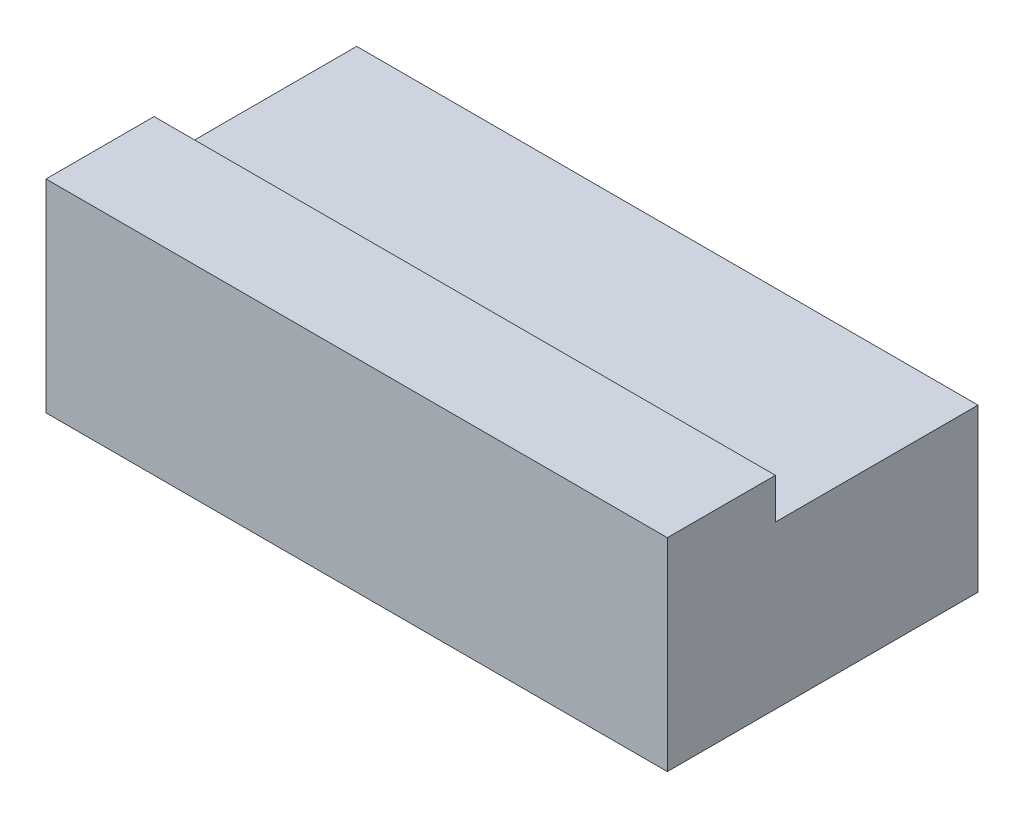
from build123d import *

# Parameters (mm, degrees)
SKETCH1_W           = 230
SKETCH1_H           = 115
BOSS_EXTRUDE1_DEPTH = 37.5
SKETCH5_W           = 230
SKETCH5_H           = 75
CUT_EXTRUDE4_DEPTH  = 15


with BuildPart() as part:
    # Sketch1 → Boss-Extrude1 (new, symmetric)
    with BuildSketch(Plane(origin=(0, 0, 0), x_dir=(1, 0, 0), z_dir=(0, 1, 0))):
        Rectangle(SKETCH1_W, SKETCH1_H)
    extrude(amount=BOSS_EXTRUDE1_DEPTH, both=True)

    # Sketch5 → Cut-Extrude4 (cut)
    with BuildSketch(Plane(origin=(0, 37.5, 0), x_dir=(1, 0, 0), z_dir=(0, 1, 0))):
        with Locations((0, 20)):
            Rectangle(SKETCH5_W, SKETCH5_H)
    extrude(amount=-CUT_EXTRUDE4_DEPTH, mode=Mode.SUBTRACT)


solid = part.part
